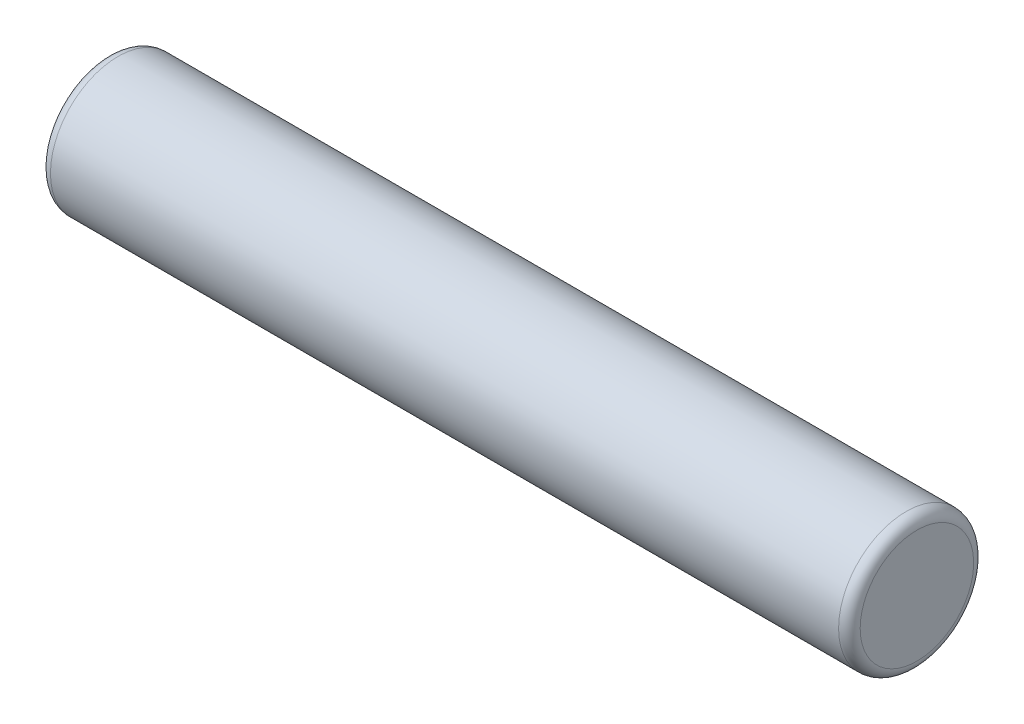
ISO-10303-21;
HEADER;
FILE_DESCRIPTION(('STEP AP214'),'2;1');
FILE_NAME('part.step','',(''),(''),'','','');
FILE_SCHEMA(('AUTOMOTIVE_DESIGN { 1 0 10303 214 1 1 1 1 }'));
ENDSEC;
DATA;
#1=APPLICATION_CONTEXT('core data for automotive mechanical design processes');
#2=APPLICATION_PROTOCOL_DEFINITION('international standard','automotive_design',2000,#1);
#3=PRODUCT_CONTEXT('',#1,'mechanical');
#4=PRODUCT('Part','Part','',(#3));
#5=PRODUCT_RELATED_PRODUCT_CATEGORY('part','',(#4));
#6=PRODUCT_DEFINITION_FORMATION('','',#4);
#7=PRODUCT_DEFINITION_CONTEXT('part definition',#1,'design');
#8=PRODUCT_DEFINITION('design','',#6,#7);
#9=PRODUCT_DEFINITION_SHAPE('','',#8);
#10=(LENGTH_UNIT() NAMED_UNIT(*) SI_UNIT(.MILLI.,.METRE.));
#11=(NAMED_UNIT(*) PLANE_ANGLE_UNIT() SI_UNIT($,.RADIAN.));
#12=(NAMED_UNIT(*) SI_UNIT($,.STERADIAN.) SOLID_ANGLE_UNIT());
#13=UNCERTAINTY_MEASURE_WITH_UNIT(LENGTH_MEASURE(1.E-05),#10,'distance_accuracy_value','');
#14=(GEOMETRIC_REPRESENTATION_CONTEXT(3) GLOBAL_UNCERTAINTY_ASSIGNED_CONTEXT((#13)) GLOBAL_UNIT_ASSIGNED_CONTEXT((#10,
#11,#12)) REPRESENTATION_CONTEXT('',''));
#15=CARTESIAN_POINT('',(0.,0.,0.));
#16=DIRECTION('',(0.,0.,1.));
#17=DIRECTION('',(1.,0.,0.));
#18=AXIS2_PLACEMENT_3D('',#15,#16,#17);
#19=CARTESIAN_POINT('',(0.,2.66953999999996,0.));
#20=DIRECTION('',(1.,0.,0.));
#21=DIRECTION('',(0.,0.,-1.));
#22=AXIS2_PLACEMENT_3D('',#19,#20,#21);
#23=PLANE('',#22);
#24=CARTESIAN_POINT('',(0.,0.,0.));
#25=DIRECTION('',(-1.,0.,0.));
#26=DIRECTION('',(0.,0.,1.));
#27=AXIS2_PLACEMENT_3D('',#24,#25,#26);
#28=CIRCLE('',#27,2.66953999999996);
#29=CARTESIAN_POINT('',(0.,0.,2.66953999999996));
#30=VERTEX_POINT('',#29);
#31=EDGE_CURVE('E51',#30,#30,#28,.T.);
#32=ORIENTED_EDGE('',*,*,#31,.T.);
#33=EDGE_LOOP('',(#32));
#34=FACE_BOUND('',#33,.T.);
#35=ADVANCED_FACE('F40',(#34),#23,.F.);
#36=CARTESIAN_POINT('',(38.1,0.,0.));
#37=DIRECTION('',(-1.,0.,0.));
#38=DIRECTION('',(0.,0.,1.));
#39=AXIS2_PLACEMENT_3D('',#36,#37,#38);
#40=PLANE('',#39);
#41=CARTESIAN_POINT('',(38.1,0.,0.));
#42=DIRECTION('',(-1.,0.,0.));
#43=DIRECTION('',(0.,0.,1.));
#44=AXIS2_PLACEMENT_3D('',#41,#42,#43);
#45=CIRCLE('',#44,2.66953999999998);
#46=CARTESIAN_POINT('',(38.1,0.,2.66953999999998));
#47=VERTEX_POINT('',#46);
#48=EDGE_CURVE('E10',#47,#47,#45,.T.);
#49=ORIENTED_EDGE('',*,*,#48,.F.);
#50=EDGE_LOOP('',(#49));
#51=FACE_BOUND('',#50,.T.);
#52=ADVANCED_FACE('F74',(#51),#40,.F.);
#53=CARTESIAN_POINT('',(37.592,0.,0.));
#54=DIRECTION('',(-1.,0.,0.));
#55=DIRECTION('',(0.,0.,1.));
#56=AXIS2_PLACEMENT_3D('',#53,#54,#55);
#57=TOROIDAL_SURFACE('',#56,2.66953999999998,0.508000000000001);
#58=CARTESIAN_POINT('',(37.592,0.,0.));
#59=DIRECTION('',(-1.,0.,0.));
#60=DIRECTION('',(0.,0.,1.));
#61=AXIS2_PLACEMENT_3D('',#58,#59,#60);
#62=CIRCLE('',#61,3.17753999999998);
#63=CARTESIAN_POINT('',(37.592,0.,3.17753999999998));
#64=VERTEX_POINT('',#63);
#65=EDGE_CURVE('E43',#64,#64,#62,.T.);
#66=ORIENTED_EDGE('',*,*,#65,.F.);
#67=EDGE_LOOP('',(#66));
#68=FACE_BOUND('',#67,.T.);
#69=ORIENTED_EDGE('',*,*,#48,.T.);
#70=EDGE_LOOP('',(#69));
#71=FACE_BOUND('',#70,.T.);
#72=ADVANCED_FACE('F68',(#68,#71),#57,.T.);
#73=CARTESIAN_POINT('',(-6.35,0.,0.));
#74=DIRECTION('',(-1.,0.,0.));
#75=DIRECTION('',(0.,0.,1.));
#76=AXIS2_PLACEMENT_3D('',#73,#74,#75);
#77=CYLINDRICAL_SURFACE('',#76,3.17753999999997);
#78=CARTESIAN_POINT('',(0.508000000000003,0.,0.));
#79=DIRECTION('',(-1.,0.,0.));
#80=DIRECTION('',(0.,0.,1.));
#81=AXIS2_PLACEMENT_3D('',#78,#79,#80);
#82=CIRCLE('',#81,3.17753999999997);
#83=CARTESIAN_POINT('',(0.508000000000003,0.,3.17753999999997));
#84=VERTEX_POINT('',#83);
#85=EDGE_CURVE('E50',#84,#84,#82,.T.);
#86=ORIENTED_EDGE('',*,*,#85,.F.);
#87=EDGE_LOOP('',(#86));
#88=FACE_BOUND('',#87,.T.);
#89=ORIENTED_EDGE('',*,*,#65,.T.);
#90=EDGE_LOOP('',(#89));
#91=FACE_BOUND('',#90,.T.);
#92=ADVANCED_FACE('F62',(#88,#91),#77,.T.);
#93=CARTESIAN_POINT('',(0.508,0.,0.));
#94=DIRECTION('',(-1.,0.,0.));
#95=DIRECTION('',(0.,0.,1.));
#96=AXIS2_PLACEMENT_3D('',#93,#94,#95);
#97=TOROIDAL_SURFACE('',#96,2.66953999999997,0.508);
#98=ORIENTED_EDGE('',*,*,#31,.F.);
#99=EDGE_LOOP('',(#98));
#100=FACE_BOUND('',#99,.T.);
#101=ORIENTED_EDGE('',*,*,#85,.T.);
#102=EDGE_LOOP('',(#101));
#103=FACE_BOUND('',#102,.T.);
#104=ADVANCED_FACE('F59',(#100,#103),#97,.T.);
#105=CLOSED_SHELL('',(#35,#52,#72,#92,#104));
#106=MANIFOLD_SOLID_BREP('B2',#105);
#107=ADVANCED_BREP_SHAPE_REPRESENTATION('',(#18,#106),#14);
#108=SHAPE_DEFINITION_REPRESENTATION(#9,#107);
ENDSEC;
END-ISO-10303-21;
